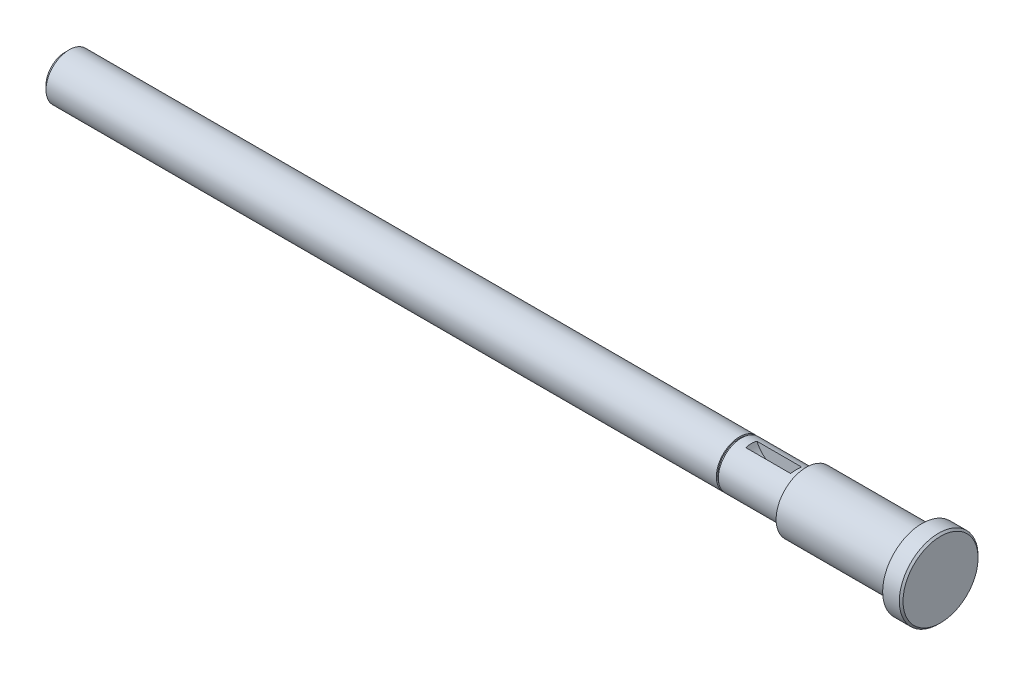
from build123d import *

# Parameters (mm, degrees)
CHANFREIN2_SIZE         = 4.5
CHANFREIN1_SIZE         = 2
ESQUISSE2_R             = 26
ENL_V_MAT_EXTRU_1_DEPTH = 6


with BuildPart() as part:
    # Esquisse1 → Base-R_volution (revolve)
    with BuildSketch(Plane.XY, mode=Mode.PRIVATE) as base_r_volution_sk:
        Polygon((0, 25), (0, 32.5), (125, 32.5), (125, 42.5), (145, 42.5), (145, 0), (-800, 0), (-800, 25), (-72, 25), (-72, 23.5), (-69.85, 23.5), (-69.85, 25), align=None)
    revolve(base_r_volution_sk.sketch.rotate(Axis((-640.64073589, 0, 0), (1, 0, 0)), 90), axis=Axis((-640.64073589, 0, 0), (1, 0, 0)))

    # Chanfrein2
    chanfrein2_edges = [part.edges().sort_by_distance(p)[0] for p in [
        (-800, 0, -25),
    ]]
    chamfer(chanfrein2_edges, length=CHANFREIN2_SIZE)

    # Chanfrein1
    chanfrein1_edges = [part.edges().sort_by_distance(p)[0] for p in [
        (145, 0, -42.5),
    ]]
    chamfer(chanfrein1_edges, length=CHANFREIN1_SIZE)

    # Esquisse2 → Enl_v. mat.-Extru.1 (cut, symmetric)
    with BuildSketch(Plane.XY):
        with Locations((-35, 34)):
            Circle(ESQUISSE2_R)
    extrude(amount=ENL_V_MAT_EXTRU_1_DEPTH, both=True, mode=Mode.SUBTRACT)


solid = part.part
